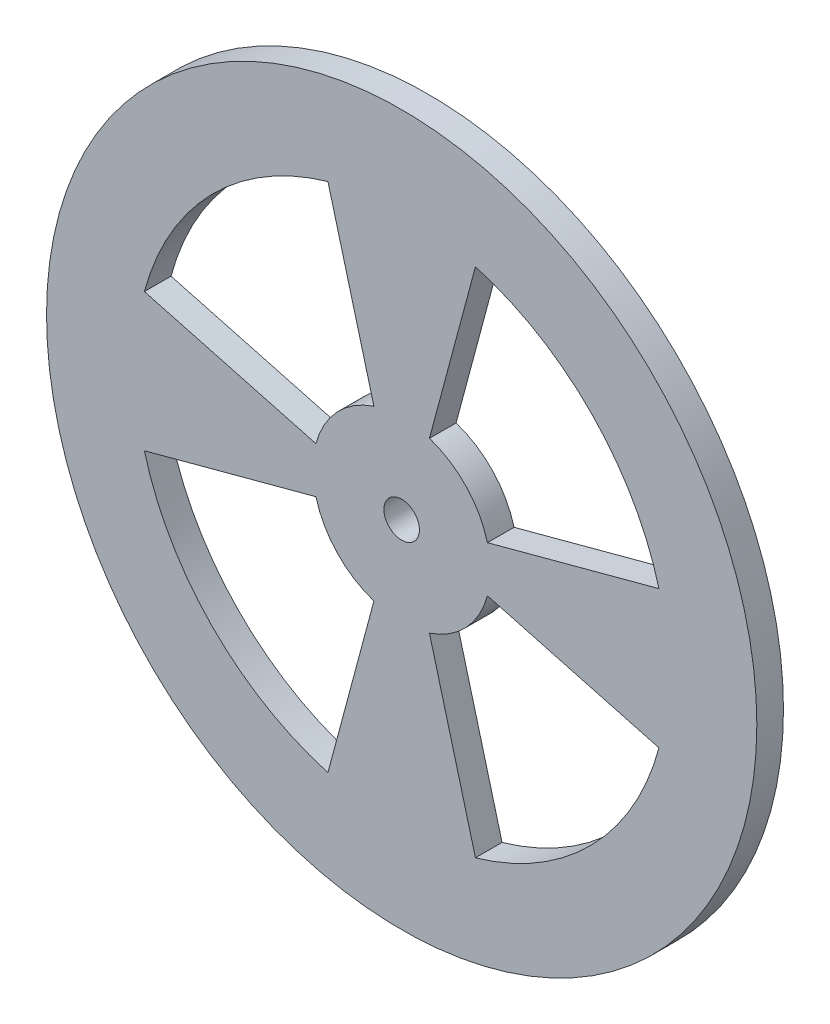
from build123d import *

# Parameters (mm, degrees)
ESQUISSE1_R        = 40
ESQUISSE1_R_2      = 30
ESQUISSE1_R_3      = 10
ESQUISSE1_R_4      = 2
BOSS_EXTRU_1_DEPTH = 3


with BuildPart() as part:
    # Esquisse1 → Boss.-Extru.1 (new body)
    # profile 1 of 6: a face of its own
    with BuildSketch(Plane.XY):
        Circle(ESQUISSE1_R)
        Circle(ESQUISSE1_R_2, mode=Mode.SUBTRACT)
    # profile 2 of 6: a face of its own
    with BuildSketch(Plane.XY):
        with BuildLine():
            Line((-3.127715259, -9.498283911), (-8.306831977, -28.827010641))
            ThreePointArc((-8.306831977, -28.827010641), (0, -30), (8.306831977, -28.827010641))
            Line((8.306831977, -28.827010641), (3.127715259, -9.498283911))
            ThreePointArc((3.127715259, -9.498283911), (0, -10), (-3.127715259, -9.498283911))
        make_face()
    # profile 3 of 6: a face of its own
    with BuildSketch(Plane.XY):
        with BuildLine():
            ThreePointArc((30, 0), (29.743345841, 3.915785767), (28.977774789, 7.764571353))
            Line((28.977774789, 7.764571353), (9.659258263, 2.588190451))
            ThreePointArc((9.659258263, 2.588190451), (9.914448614, 1.305261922), (10, 0))
            ThreePointArc((10, 0), (9.914448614, -1.305261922), (9.659258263, -2.588190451))
            Line((9.659258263, -2.588190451), (28.977774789, -7.764571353))
            ThreePointArc((28.977774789, -7.764571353), (29.743345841, -3.915785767), (30, 0))
        make_face()
    # profile 4 of 6: a face of its own
    with BuildSketch(Plane.XY):
        Circle(ESQUISSE1_R_3)
        Circle(ESQUISSE1_R_4, mode=Mode.SUBTRACT)
    # profile 5 of 6: a face of its own
    with BuildSketch(Plane.XY):
        with BuildLine():
            ThreePointArc((8.306831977, 28.827010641), (0, 30), (-8.306831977, 28.827010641))
            Line((-8.306831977, 28.827010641), (-3.127715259, 9.498283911))
            ThreePointArc((-3.127715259, 9.498283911), (0, 10), (3.127715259, 9.498283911))
            Line((3.127715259, 9.498283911), (8.306831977, 28.827010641))
        make_face()
    # profile 6 of 6: a face of its own
    with BuildSketch(Plane.XY):
        with BuildLine():
            Line((-9.659258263, 2.588190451), (-28.977774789, 7.764571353))
            ThreePointArc((-28.977774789, 7.764571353), (-30, 0), (-28.977774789, -7.764571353))
            Line((-28.977774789, -7.764571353), (-9.659258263, -2.588190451))
            ThreePointArc((-9.659258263, -2.588190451), (-10, 0), (-9.659258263, 2.588190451))
        make_face()
    extrude(amount=BOSS_EXTRU_1_DEPTH)


solid = part.part
